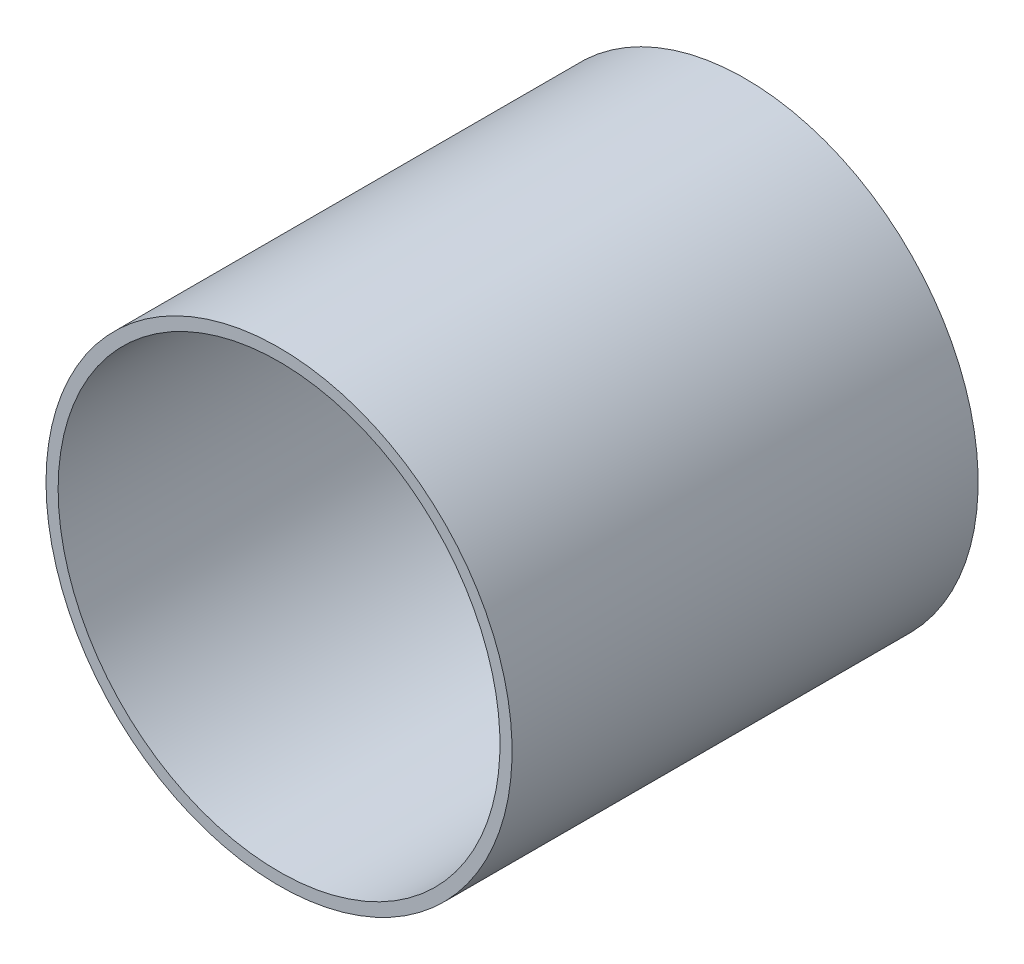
from build123d import *


with BuildPart() as part:
    # Sketch1 → Revolve1 (revolve)
    with BuildSketch(Plane(origin=(0, 0, 0), x_dir=(1, 0, 0), z_dir=(0, 1, 0))):
        Polygon((-30.099, 0), (-31.75, 0), (-31.75, -6.35), (-31.75, -63.5), (-30.099, -63.5), align=None)
    revolve(axis=Axis((0, 0, 0), (0, 0, 1)))


solid = part.part
